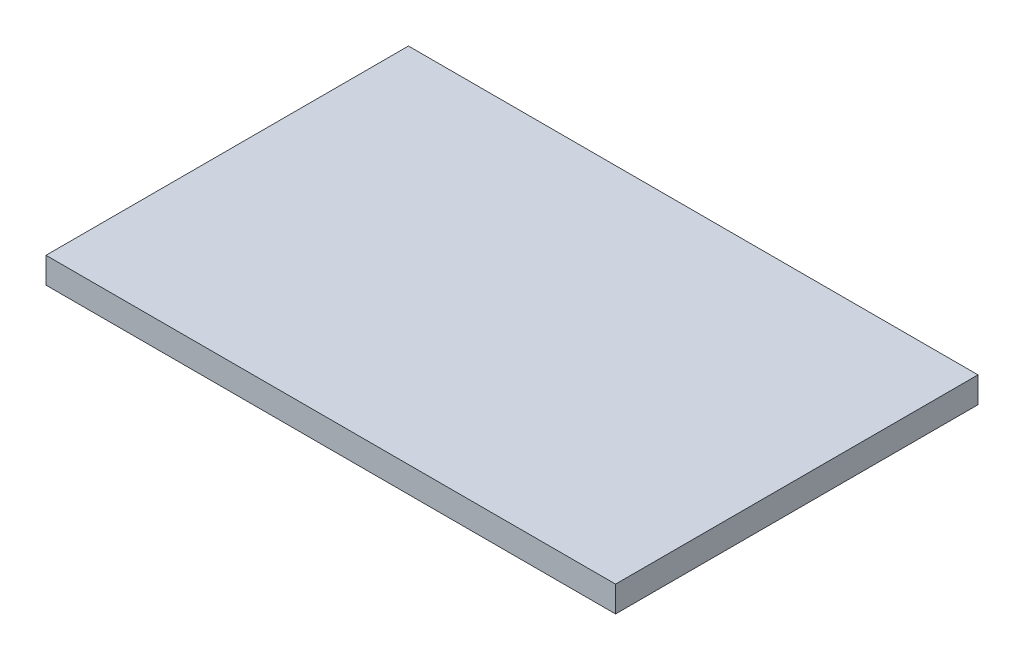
from build123d import *

# Parameters (mm, degrees)
SKETCH1_W           = 110
SKETCH1_H           = 70
BOSS_EXTRUDE1_DEPTH = 5


with BuildPart() as part:
    # Sketch1 → Boss-Extrude1 (new body)
    with BuildSketch(Plane(origin=(0, 0, 0), x_dir=(1, 0, 0), z_dir=(0, 1, 0))):
        Rectangle(SKETCH1_W, SKETCH1_H)
    extrude(amount=BOSS_EXTRUDE1_DEPTH)


solid = part.part
